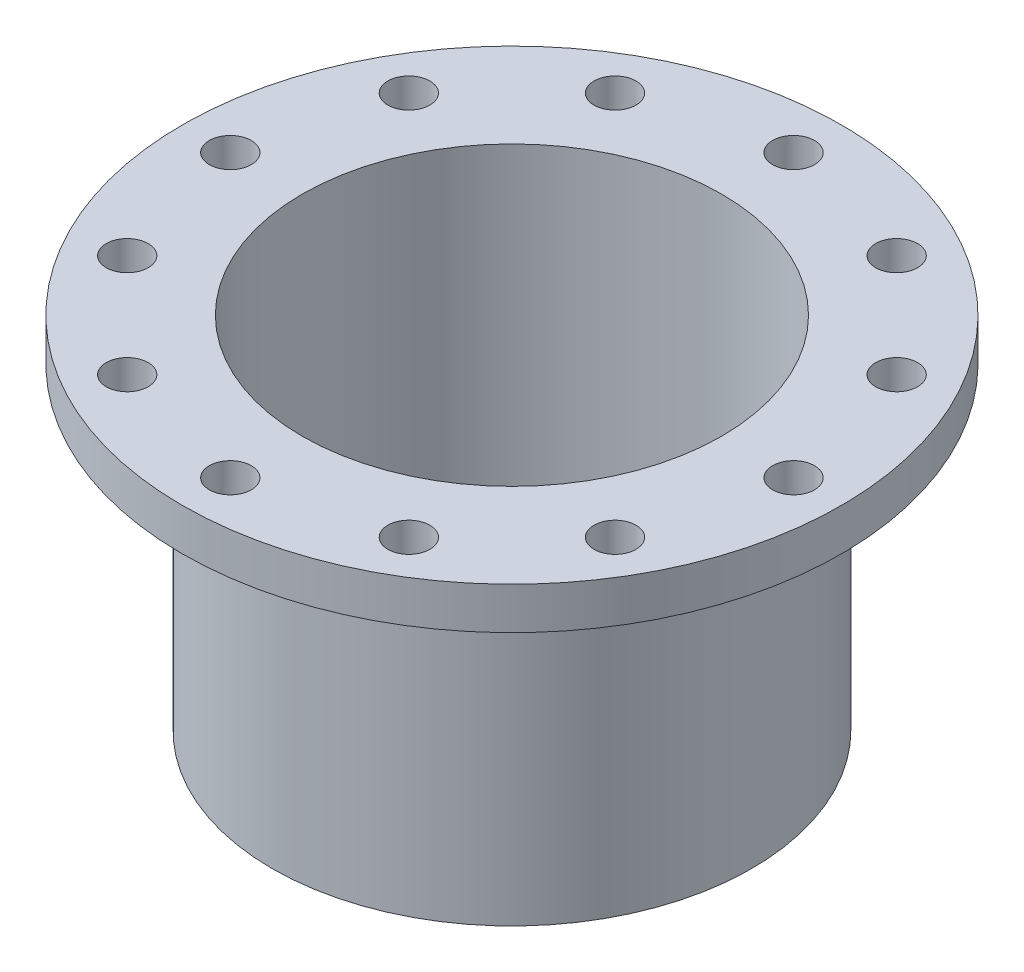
from build123d import *

# Parameters (mm, degrees)
SKETCH1_R           = 200
SKETCH1_R_2         = 175
BOSS_EXTRUDE1_DEPTH = 300
BOSS_EXTRUDE2_START = -35
SKETCH2_R           = 275
SKETCH2_R_2         = 175
BOSS_EXTRUDE2_DEPTH = 35
CUT_EXTRUDE1_REACH  = 493.172
SKETCH3_R           = 17.5
CIRPATTERN1_COUNT   = 12


with BuildPart() as part:
    # Sketch1 → Boss-Extrude1 (new body)
    with BuildSketch(Plane(origin=(0, 0, 0), x_dir=(1, 0, 0), z_dir=(0, 1, 0))):
        with Locations(Location((0, 0, 0), (0, 0, 270))):
            Circle(SKETCH1_R)
        with Locations(Location((0, 0, 0), (0, 0, 270))):
            Circle(SKETCH1_R_2, mode=Mode.SUBTRACT)
    extrude(amount=BOSS_EXTRUDE1_DEPTH)

    # Sketch2 → Boss-Extrude2 (add)
    with BuildSketch(Plane(origin=(0, 300, 0), x_dir=(1, 0, 0), z_dir=(0, 1, 0)).offset(BOSS_EXTRUDE2_START)):
        with Locations(Location((0, 0, 0), (0, 0, 270))):
            Circle(SKETCH2_R)
        with Locations(Location((0, 0, 0), (0, 0, 270))):
            Circle(SKETCH2_R_2, mode=Mode.SUBTRACT)
    extrude(amount=BOSS_EXTRUDE2_DEPTH)

    # Sketch3 → Cut-Extrude1 (cut, up to next)
    with BuildSketch(Plane(origin=(0, 300, 0), x_dir=(1, 0, 0), z_dir=(0, 1, 0)), mode=Mode.PRIVATE) as cut_extrude1_sk1:
        with Locations(Location((0, 235, 0), (0, 0, 270))):
            Circle(SKETCH3_R)
    cut_extrude1_tool1 = extrude(cut_extrude1_sk1.sketch, amount=-CUT_EXTRUDE1_REACH, mode=Mode.PRIVATE) & part.part
    cut_extrude1 = cut_extrude1_tool1.solids().sort_by_distance((0, 300, -235))[0]
    add(cut_extrude1, mode=Mode.SUBTRACT)

    # CirPattern1: Cut-Extrude1 ×12 about axis
    cirpattern1_axis = Axis((0, 0, 0), (0, 1, 0))
    for i in range(1, CIRPATTERN1_COUNT):
        add(cut_extrude1.rotate(cirpattern1_axis, i * 360 / CIRPATTERN1_COUNT), mode=Mode.SUBTRACT)


solid = part.part
